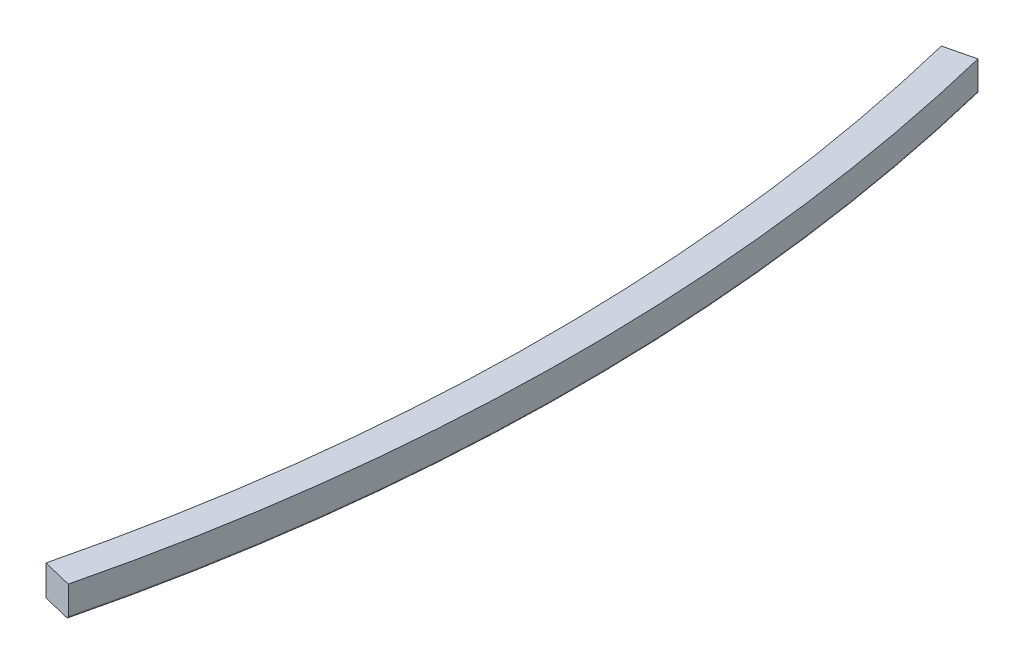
ISO-10303-21;
HEADER;
FILE_DESCRIPTION(('STEP AP214'),'2;1');
FILE_NAME('part.step','',(''),(''),'','','');
FILE_SCHEMA(('AUTOMOTIVE_DESIGN { 1 0 10303 214 1 1 1 1 }'));
ENDSEC;
DATA;
#1=APPLICATION_CONTEXT('core data for automotive mechanical design processes');
#2=APPLICATION_PROTOCOL_DEFINITION('international standard','automotive_design',2000,#1);
#3=PRODUCT_CONTEXT('',#1,'mechanical');
#4=PRODUCT('Part','Part','',(#3));
#5=PRODUCT_RELATED_PRODUCT_CATEGORY('part','',(#4));
#6=PRODUCT_DEFINITION_FORMATION('','',#4);
#7=PRODUCT_DEFINITION_CONTEXT('part definition',#1,'design');
#8=PRODUCT_DEFINITION('design','',#6,#7);
#9=PRODUCT_DEFINITION_SHAPE('','',#8);
#10=(LENGTH_UNIT() NAMED_UNIT(*) SI_UNIT(.MILLI.,.METRE.));
#11=(NAMED_UNIT(*) PLANE_ANGLE_UNIT() SI_UNIT($,.RADIAN.));
#12=(NAMED_UNIT(*) SI_UNIT($,.STERADIAN.) SOLID_ANGLE_UNIT());
#13=UNCERTAINTY_MEASURE_WITH_UNIT(LENGTH_MEASURE(1.E-05),#10,'distance_accuracy_value','');
#14=(GEOMETRIC_REPRESENTATION_CONTEXT(3) GLOBAL_UNCERTAINTY_ASSIGNED_CONTEXT((#13)) GLOBAL_UNIT_ASSIGNED_CONTEXT((#10,
#11,#12)) REPRESENTATION_CONTEXT('',''));
#15=CARTESIAN_POINT('',(0.,0.,0.));
#16=DIRECTION('',(0.,0.,1.));
#17=DIRECTION('',(1.,0.,0.));
#18=AXIS2_PLACEMENT_3D('',#15,#16,#17);
#19=CARTESIAN_POINT('',(-2504.99999999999,0.,0.));
#20=DIRECTION('',(0.,1.,0.));
#21=DIRECTION('',(0.,0.,1.));
#22=AXIS2_PLACEMENT_3D('',#19,#20,#21);
#23=CYLINDRICAL_SURFACE('',#22,2484.99999999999);
#24=CARTESIAN_POINT('',(-2504.99999999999,20.,0.));
#25=DIRECTION('',(0.,1.,0.));
#26=DIRECTION('',(0.,0.,1.));
#27=AXIS2_PLACEMENT_3D('',#24,#25,#26);
#28=CIRCLE('',#27,2484.99999999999);
#29=CARTESIAN_POINT('',(-91.1771820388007,20.,590.49504950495));
#30=VERTEX_POINT('',#29);
#31=CARTESIAN_POINT('',(-91.1771820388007,20.,-590.49504950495));
#32=VERTEX_POINT('',#31);
#33=EDGE_CURVE('E126',#30,#32,#28,.T.);
#34=ORIENTED_EDGE('',*,*,#33,.T.);
#35=DIRECTION('',(0.,-1.,0.));
#36=VECTOR('',#35,1.);
#37=CARTESIAN_POINT('',(-91.1771820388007,-20.,-590.49504950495));
#38=LINE('',#37,#36);
#39=CARTESIAN_POINT('',(-91.1771820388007,-20.,-590.49504950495));
#40=VERTEX_POINT('',#39);
#41=EDGE_CURVE('E122',#32,#40,#38,.T.);
#42=ORIENTED_EDGE('',*,*,#41,.T.);
#43=CARTESIAN_POINT('',(-2504.99999999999,-20.,0.));
#44=DIRECTION('',(0.,1.,0.));
#45=DIRECTION('',(0.,0.,1.));
#46=AXIS2_PLACEMENT_3D('',#43,#44,#45);
#47=CIRCLE('',#46,2484.99999999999);
#48=CARTESIAN_POINT('',(-91.1771820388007,-20.,590.49504950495));
#49=VERTEX_POINT('',#48);
#50=EDGE_CURVE('E107',#49,#40,#47,.T.);
#51=ORIENTED_EDGE('',*,*,#50,.F.);
#52=DIRECTION('',(0.,-1.,0.));
#53=VECTOR('',#52,1.);
#54=CARTESIAN_POINT('',(-91.1771820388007,-20.,590.49504950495));
#55=LINE('',#54,#53);
#56=EDGE_CURVE('E136',#30,#49,#55,.T.);
#57=ORIENTED_EDGE('',*,*,#56,.F.);
#58=EDGE_LOOP('',(#34,#42,#51,#57));
#59=FACE_BOUND('',#58,.T.);
#60=ADVANCED_FACE('F52',(#59),#23,.F.);
#61=CARTESIAN_POINT('',(-91.1771820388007,20.,590.49504950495));
#62=DIRECTION('',(0.,-1.,0.));
#63=DIRECTION('',(0.,0.,-1.));
#64=AXIS2_PLACEMENT_3D('',#61,#62,#63);
#65=PLANE('',#64);
#66=CARTESIAN_POINT('',(-2504.99999999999,20.,0.));
#67=DIRECTION('',(0.,1.,0.));
#68=DIRECTION('',(0.,0.,1.));
#69=AXIS2_PLACEMENT_3D('',#66,#67,#68);
#70=CIRCLE('',#69,2524.99999999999);
#71=CARTESIAN_POINT('',(-52.3228912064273,20.,600.));
#72=VERTEX_POINT('',#71);
#73=CARTESIAN_POINT('',(-52.3228912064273,20.,-600.));
#74=VERTEX_POINT('',#73);
#75=EDGE_CURVE('E116',#72,#74,#70,.T.);
#76=ORIENTED_EDGE('',*,*,#75,.T.);
#77=DIRECTION('',(-0.971357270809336,0.,0.237623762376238));
#78=VECTOR('',#77,1.);
#79=CARTESIAN_POINT('',(-91.1771820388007,20.,-590.49504950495));
#80=LINE('',#79,#78);
#81=EDGE_CURVE('E134',#74,#32,#80,.T.);
#82=ORIENTED_EDGE('',*,*,#81,.T.);
#83=ORIENTED_EDGE('',*,*,#33,.F.);
#84=DIRECTION('',(-0.971357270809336,0.,-0.237623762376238));
#85=VECTOR('',#84,1.);
#86=CARTESIAN_POINT('',(-91.1771820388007,20.,590.49504950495));
#87=LINE('',#86,#85);
#88=EDGE_CURVE('E117',#72,#30,#87,.T.);
#89=ORIENTED_EDGE('',*,*,#88,.F.);
#90=EDGE_LOOP('',(#76,#82,#83,#89));
#91=FACE_BOUND('',#90,.T.);
#92=ADVANCED_FACE('F180',(#91),#65,.F.);
#93=CARTESIAN_POINT('',(-2504.99999999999,0.,0.));
#94=DIRECTION('',(0.,1.,0.));
#95=DIRECTION('',(0.,0.,1.));
#96=AXIS2_PLACEMENT_3D('',#93,#94,#95);
#97=CYLINDRICAL_SURFACE('',#96,2524.99999999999);
#98=DIRECTION('',(0.,1.,0.));
#99=VECTOR('',#98,1.);
#100=CARTESIAN_POINT('',(-52.3228912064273,-20.,600.));
#101=LINE('',#100,#99);
#102=CARTESIAN_POINT('',(-52.3228912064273,-17.,600.));
#103=VERTEX_POINT('',#102);
#104=EDGE_CURVE('E141',#103,#72,#101,.T.);
#105=ORIENTED_EDGE('',*,*,#104,.F.);
#106=CARTESIAN_POINT('',(-2504.99999999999,-17.,0.));
#107=DIRECTION('',(0.,1.,0.));
#108=DIRECTION('',(0.,0.,1.));
#109=AXIS2_PLACEMENT_3D('',#106,#107,#108);
#110=CIRCLE('',#109,2524.99999999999);
#111=CARTESIAN_POINT('',(-52.3228912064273,-17.,-600.));
#112=VERTEX_POINT('',#111);
#113=EDGE_CURVE('E152',#103,#112,#110,.T.);
#114=ORIENTED_EDGE('',*,*,#113,.T.);
#115=DIRECTION('',(0.,1.,0.));
#116=VECTOR('',#115,1.);
#117=CARTESIAN_POINT('',(-52.3228912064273,-20.,-600.));
#118=LINE('',#117,#116);
#119=EDGE_CURVE('E124',#112,#74,#118,.T.);
#120=ORIENTED_EDGE('',*,*,#119,.T.);
#121=ORIENTED_EDGE('',*,*,#75,.F.);
#122=EDGE_LOOP('',(#105,#114,#120,#121));
#123=FACE_BOUND('',#122,.T.);
#124=ADVANCED_FACE('F175',(#123),#97,.T.);
#125=CARTESIAN_POINT('',(-91.1771820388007,-20.,590.49504950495));
#126=DIRECTION('',(0.,1.,0.));
#127=DIRECTION('',(0.,0.,1.));
#128=AXIS2_PLACEMENT_3D('',#125,#126,#127);
#129=PLANE('',#128);
#130=DIRECTION('',(0.971357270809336,0.,-0.237623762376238));
#131=VECTOR('',#130,1.);
#132=CARTESIAN_POINT('',(-91.1771820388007,-20.,-590.49504950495));
#133=LINE('',#132,#131);
#134=CARTESIAN_POINT('',(-55.2369630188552,-20.,-599.287128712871));
#135=VERTEX_POINT('',#134);
#136=EDGE_CURVE('E109',#40,#135,#133,.T.);
#137=ORIENTED_EDGE('',*,*,#136,.T.);
#138=CARTESIAN_POINT('',(-2504.99999999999,-20.,0.));
#139=DIRECTION('',(0.,1.,0.));
#140=DIRECTION('',(0.,0.,1.));
#141=AXIS2_PLACEMENT_3D('',#138,#139,#140);
#142=CIRCLE('',#141,2521.99999999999);
#143=CARTESIAN_POINT('',(-55.2369630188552,-20.,599.287128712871));
#144=VERTEX_POINT('',#143);
#145=EDGE_CURVE('E61',#135,#144,#142,.F.);
#146=ORIENTED_EDGE('',*,*,#145,.T.);
#147=DIRECTION('',(0.971357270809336,0.,0.237623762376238));
#148=VECTOR('',#147,1.);
#149=CARTESIAN_POINT('',(-91.1771820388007,-20.,590.49504950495));
#150=LINE('',#149,#148);
#151=EDGE_CURVE('E110',#49,#144,#150,.T.);
#152=ORIENTED_EDGE('',*,*,#151,.F.);
#153=ORIENTED_EDGE('',*,*,#50,.T.);
#154=EDGE_LOOP('',(#137,#146,#152,#153));
#155=FACE_BOUND('',#154,.T.);
#156=ADVANCED_FACE('F108',(#155),#129,.F.);
#157=CARTESIAN_POINT('',(-71.750036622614,0.,595.247524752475));
#158=DIRECTION('',(0.237623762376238,0.,-0.971357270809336));
#159=DIRECTION('',(-0.971357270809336,0.,-0.237623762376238));
#160=AXIS2_PLACEMENT_3D('',#157,#158,#159);
#161=PLANE('',#160);
#162=ORIENTED_EDGE('',*,*,#151,.T.);
#163=CARTESIAN_POINT('',(-55.2369630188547,-17.,599.287128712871));
#164=DIRECTION('',(0.237623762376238,0.,-0.971357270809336));
#165=DIRECTION('',(-0.971357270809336,0.,-0.237623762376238));
#166=AXIS2_PLACEMENT_3D('',#163,#164,#165);
#167=CIRCLE('',#166,3.);
#168=EDGE_CURVE('E13',#144,#103,#167,.F.);
#169=ORIENTED_EDGE('',*,*,#168,.T.);
#170=ORIENTED_EDGE('',*,*,#104,.T.);
#171=ORIENTED_EDGE('',*,*,#88,.T.);
#172=ORIENTED_EDGE('',*,*,#56,.T.);
#173=EDGE_LOOP('',(#162,#169,#170,#171,#172));
#174=FACE_BOUND('',#173,.T.);
#175=ADVANCED_FACE('F183',(#174),#161,.F.);
#176=CARTESIAN_POINT('',(-71.750036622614,0.,-595.247524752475));
#177=DIRECTION('',(0.237623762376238,0.,0.971357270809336));
#178=DIRECTION('',(-0.971357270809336,0.,0.237623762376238));
#179=AXIS2_PLACEMENT_3D('',#176,#177,#178);
#180=PLANE('',#179);
#181=ORIENTED_EDGE('',*,*,#119,.F.);
#182=CARTESIAN_POINT('',(-55.2369630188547,-17.,-599.287128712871));
#183=DIRECTION('',(0.237623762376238,0.,0.971357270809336));
#184=DIRECTION('',(0.971357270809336,0.,-0.237623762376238));
#185=AXIS2_PLACEMENT_3D('',#182,#183,#184);
#186=CIRCLE('',#185,3.);
#187=EDGE_CURVE('E80',#112,#135,#186,.F.);
#188=ORIENTED_EDGE('',*,*,#187,.T.);
#189=ORIENTED_EDGE('',*,*,#136,.F.);
#190=ORIENTED_EDGE('',*,*,#41,.F.);
#191=ORIENTED_EDGE('',*,*,#81,.F.);
#192=EDGE_LOOP('',(#181,#188,#189,#190,#191));
#193=FACE_BOUND('',#192,.T.);
#194=ADVANCED_FACE('F120',(#193),#180,.F.);
#195=CARTESIAN_POINT('',(-2504.99999999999,-17.,0.));
#196=DIRECTION('',(0.,1.,0.));
#197=DIRECTION('',(0.,0.,1.));
#198=AXIS2_PLACEMENT_3D('',#195,#196,#197);
#199=TOROIDAL_SURFACE('',#198,2521.99999999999,3.);
#200=ORIENTED_EDGE('',*,*,#168,.F.);
#201=ORIENTED_EDGE('',*,*,#145,.F.);
#202=ORIENTED_EDGE('',*,*,#187,.F.);
#203=ORIENTED_EDGE('',*,*,#113,.F.);
#204=EDGE_LOOP('',(#200,#201,#202,#203));
#205=FACE_BOUND('',#204,.T.);
#206=ADVANCED_FACE('F54',(#205),#199,.T.);
#207=CLOSED_SHELL('',(#60,#92,#124,#156,#175,#194,#206));
#208=MANIFOLD_SOLID_BREP('B2',#207);
#209=ADVANCED_BREP_SHAPE_REPRESENTATION('',(#18,#208),#14);
#210=SHAPE_DEFINITION_REPRESENTATION(#9,#209);
ENDSEC;
END-ISO-10303-21;
